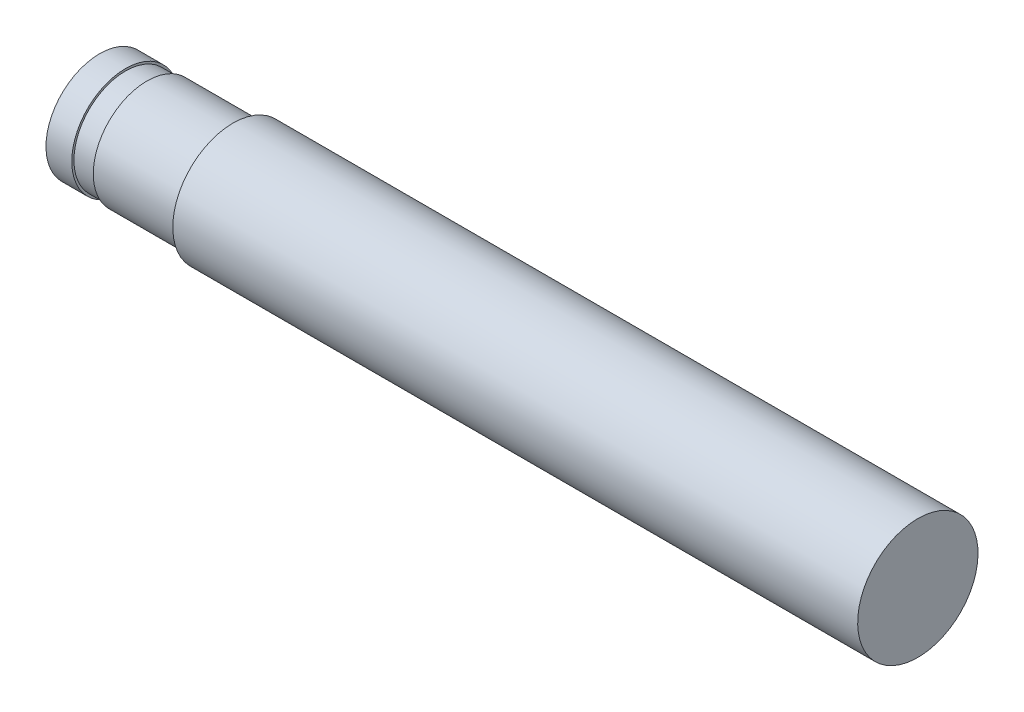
ISO-10303-21;
HEADER;
FILE_DESCRIPTION(('STEP AP214'),'2;1');
FILE_NAME('part.step','',(''),(''),'','','');
FILE_SCHEMA(('AUTOMOTIVE_DESIGN { 1 0 10303 214 1 1 1 1 }'));
ENDSEC;
DATA;
#1=APPLICATION_CONTEXT('core data for automotive mechanical design processes');
#2=APPLICATION_PROTOCOL_DEFINITION('international standard','automotive_design',2000,#1);
#3=PRODUCT_CONTEXT('',#1,'mechanical');
#4=PRODUCT('Part','Part','',(#3));
#5=PRODUCT_RELATED_PRODUCT_CATEGORY('part','',(#4));
#6=PRODUCT_DEFINITION_FORMATION('','',#4);
#7=PRODUCT_DEFINITION_CONTEXT('part definition',#1,'design');
#8=PRODUCT_DEFINITION('design','',#6,#7);
#9=PRODUCT_DEFINITION_SHAPE('','',#8);
#10=(LENGTH_UNIT() NAMED_UNIT(*) SI_UNIT(.MILLI.,.METRE.));
#11=(NAMED_UNIT(*) PLANE_ANGLE_UNIT() SI_UNIT($,.RADIAN.));
#12=(NAMED_UNIT(*) SI_UNIT($,.STERADIAN.) SOLID_ANGLE_UNIT());
#13=UNCERTAINTY_MEASURE_WITH_UNIT(LENGTH_MEASURE(1.E-05),#10,'distance_accuracy_value','');
#14=(GEOMETRIC_REPRESENTATION_CONTEXT(3) GLOBAL_UNCERTAINTY_ASSIGNED_CONTEXT((#13)) GLOBAL_UNIT_ASSIGNED_CONTEXT((#10,
#11,#12)) REPRESENTATION_CONTEXT('',''));
#15=CARTESIAN_POINT('',(0.,0.,0.));
#16=DIRECTION('',(0.,0.,1.));
#17=DIRECTION('',(1.,0.,0.));
#18=AXIS2_PLACEMENT_3D('',#15,#16,#17);
#19=CARTESIAN_POINT('',(-553.,37.4999999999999,0.));
#20=DIRECTION('',(1.,0.,0.));
#21=DIRECTION('',(0.,1.,0.));
#22=AXIS2_PLACEMENT_3D('',#19,#20,#21);
#23=PLANE('',#22);
#24=CARTESIAN_POINT('',(-553.,0.,0.));
#25=DIRECTION('',(1.,0.,0.));
#26=DIRECTION('',(0.,1.,0.));
#27=AXIS2_PLACEMENT_3D('',#24,#25,#26);
#28=CIRCLE('',#27,37.5);
#29=CARTESIAN_POINT('',(-553.,37.4999999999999,0.));
#30=VERTEX_POINT('',#29);
#31=EDGE_CURVE('E10',#30,#30,#28,.T.);
#32=ORIENTED_EDGE('',*,*,#31,.T.);
#33=EDGE_LOOP('',(#32));
#34=FACE_BOUND('',#33,.T.);
#35=CARTESIAN_POINT('',(-553.,0.,0.));
#36=DIRECTION('',(1.,0.,0.));
#37=DIRECTION('',(0.,1.,0.));
#38=AXIS2_PLACEMENT_3D('',#35,#36,#37);
#39=CIRCLE('',#38,36.);
#40=CARTESIAN_POINT('',(-553.,35.9999999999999,0.));
#41=VERTEX_POINT('',#40);
#42=EDGE_CURVE('E58',#41,#41,#39,.T.);
#43=ORIENTED_EDGE('',*,*,#42,.F.);
#44=EDGE_LOOP('',(#43));
#45=FACE_BOUND('',#44,.T.);
#46=ADVANCED_FACE('F30',(#34,#45),#23,.T.);
#47=CARTESIAN_POINT('',(0.,0.,0.));
#48=DIRECTION('',(1.,0.,0.));
#49=DIRECTION('',(0.,1.,0.));
#50=AXIS2_PLACEMENT_3D('',#47,#48,#49);
#51=CYLINDRICAL_SURFACE('',#50,37.5);
#52=CARTESIAN_POINT('',(-571.,0.,0.));
#53=DIRECTION('',(1.,0.,0.));
#54=DIRECTION('',(0.,1.,0.));
#55=AXIS2_PLACEMENT_3D('',#52,#53,#54);
#56=CIRCLE('',#55,37.5);
#57=CARTESIAN_POINT('',(-571.,37.4999999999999,0.));
#58=VERTEX_POINT('',#57);
#59=EDGE_CURVE('E36',#58,#58,#56,.T.);
#60=ORIENTED_EDGE('',*,*,#59,.T.);
#61=EDGE_LOOP('',(#60));
#62=FACE_BOUND('',#61,.T.);
#63=ORIENTED_EDGE('',*,*,#31,.F.);
#64=EDGE_LOOP('',(#63));
#65=FACE_BOUND('',#64,.T.);
#66=ADVANCED_FACE('F66',(#62,#65),#51,.T.);
#67=CARTESIAN_POINT('',(-571.,37.4999999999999,0.));
#68=DIRECTION('',(-1.,0.,0.));
#69=DIRECTION('',(0.,-1.,0.));
#70=AXIS2_PLACEMENT_3D('',#67,#68,#69);
#71=PLANE('',#70);
#72=ORIENTED_EDGE('',*,*,#59,.F.);
#73=EDGE_LOOP('',(#72));
#74=FACE_BOUND('',#73,.T.);
#75=ADVANCED_FACE('F70',(#74),#71,.T.);
#76=CARTESIAN_POINT('',(0.,42.,0.));
#77=DIRECTION('',(1.,0.,0.));
#78=DIRECTION('',(0.,1.,0.));
#79=AXIS2_PLACEMENT_3D('',#76,#77,#78);
#80=PLANE('',#79);
#81=CARTESIAN_POINT('',(0.,0.,0.));
#82=DIRECTION('',(1.,0.,0.));
#83=DIRECTION('',(0.,1.,0.));
#84=AXIS2_PLACEMENT_3D('',#81,#82,#83);
#85=CIRCLE('',#84,42.);
#86=CARTESIAN_POINT('',(0.,42.,0.));
#87=VERTEX_POINT('',#86);
#88=EDGE_CURVE('E40',#87,#87,#85,.T.);
#89=ORIENTED_EDGE('',*,*,#88,.T.);
#90=EDGE_LOOP('',(#89));
#91=FACE_BOUND('',#90,.T.);
#92=ADVANCED_FACE('F74',(#91),#80,.T.);
#93=CARTESIAN_POINT('',(0.,0.,0.));
#94=DIRECTION('',(1.,0.,0.));
#95=DIRECTION('',(0.,1.,0.));
#96=AXIS2_PLACEMENT_3D('',#93,#94,#95);
#97=CYLINDRICAL_SURFACE('',#96,42.);
#98=CARTESIAN_POINT('',(-478.,0.,0.));
#99=DIRECTION('',(1.,0.,0.));
#100=DIRECTION('',(0.,1.,0.));
#101=AXIS2_PLACEMENT_3D('',#98,#99,#100);
#102=CIRCLE('',#101,42.0000000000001);
#103=CARTESIAN_POINT('',(-478.,42.,0.));
#104=VERTEX_POINT('',#103);
#105=EDGE_CURVE('E44',#104,#104,#102,.T.);
#106=ORIENTED_EDGE('',*,*,#105,.T.);
#107=EDGE_LOOP('',(#106));
#108=FACE_BOUND('',#107,.T.);
#109=ORIENTED_EDGE('',*,*,#88,.F.);
#110=EDGE_LOOP('',(#109));
#111=FACE_BOUND('',#110,.T.);
#112=ADVANCED_FACE('F81',(#108,#111),#97,.T.);
#113=CARTESIAN_POINT('',(-478.,37.4999999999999,0.));
#114=DIRECTION('',(-1.,0.,0.));
#115=DIRECTION('',(0.,-1.,0.));
#116=AXIS2_PLACEMENT_3D('',#113,#114,#115);
#117=PLANE('',#116);
#118=CARTESIAN_POINT('',(-478.,0.,0.));
#119=DIRECTION('',(1.,0.,0.));
#120=DIRECTION('',(0.,1.,0.));
#121=AXIS2_PLACEMENT_3D('',#118,#119,#120);
#122=CIRCLE('',#121,37.5);
#123=CARTESIAN_POINT('',(-478.,37.4999999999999,0.));
#124=VERTEX_POINT('',#123);
#125=EDGE_CURVE('E49',#124,#124,#122,.T.);
#126=ORIENTED_EDGE('',*,*,#125,.T.);
#127=EDGE_LOOP('',(#126));
#128=FACE_BOUND('',#127,.T.);
#129=ORIENTED_EDGE('',*,*,#105,.F.);
#130=EDGE_LOOP('',(#129));
#131=FACE_BOUND('',#130,.T.);
#132=ADVANCED_FACE('F85',(#128,#131),#117,.T.);
#133=CARTESIAN_POINT('',(0.,0.,0.));
#134=DIRECTION('',(1.,0.,0.));
#135=DIRECTION('',(0.,1.,0.));
#136=AXIS2_PLACEMENT_3D('',#133,#134,#135);
#137=CYLINDRICAL_SURFACE('',#136,37.5);
#138=CARTESIAN_POINT('',(-538.,0.,0.));
#139=DIRECTION('',(1.,0.,0.));
#140=DIRECTION('',(0.,1.,0.));
#141=AXIS2_PLACEMENT_3D('',#138,#139,#140);
#142=CIRCLE('',#141,37.5);
#143=CARTESIAN_POINT('',(-538.,37.4999999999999,0.));
#144=VERTEX_POINT('',#143);
#145=EDGE_CURVE('E52',#144,#144,#142,.T.);
#146=ORIENTED_EDGE('',*,*,#145,.T.);
#147=EDGE_LOOP('',(#146));
#148=FACE_BOUND('',#147,.T.);
#149=ORIENTED_EDGE('',*,*,#125,.F.);
#150=EDGE_LOOP('',(#149));
#151=FACE_BOUND('',#150,.T.);
#152=ADVANCED_FACE('F89',(#148,#151),#137,.T.);
#153=CARTESIAN_POINT('',(-538.,35.9999999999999,0.));
#154=DIRECTION('',(-1.,0.,0.));
#155=DIRECTION('',(0.,-1.,0.));
#156=AXIS2_PLACEMENT_3D('',#153,#154,#155);
#157=PLANE('',#156);
#158=CARTESIAN_POINT('',(-538.,0.,0.));
#159=DIRECTION('',(1.,0.,0.));
#160=DIRECTION('',(0.,1.,0.));
#161=AXIS2_PLACEMENT_3D('',#158,#159,#160);
#162=CIRCLE('',#161,36.);
#163=CARTESIAN_POINT('',(-538.,35.9999999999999,0.));
#164=VERTEX_POINT('',#163);
#165=EDGE_CURVE('E55',#164,#164,#162,.T.);
#166=ORIENTED_EDGE('',*,*,#165,.T.);
#167=EDGE_LOOP('',(#166));
#168=FACE_BOUND('',#167,.T.);
#169=ORIENTED_EDGE('',*,*,#145,.F.);
#170=EDGE_LOOP('',(#169));
#171=FACE_BOUND('',#170,.T.);
#172=ADVANCED_FACE('F93',(#168,#171),#157,.T.);
#173=CARTESIAN_POINT('',(0.,0.,0.));
#174=DIRECTION('',(1.,0.,0.));
#175=DIRECTION('',(0.,1.,0.));
#176=AXIS2_PLACEMENT_3D('',#173,#174,#175);
#177=CYLINDRICAL_SURFACE('',#176,36.);
#178=ORIENTED_EDGE('',*,*,#42,.T.);
#179=EDGE_LOOP('',(#178));
#180=FACE_BOUND('',#179,.T.);
#181=ORIENTED_EDGE('',*,*,#165,.F.);
#182=EDGE_LOOP('',(#181));
#183=FACE_BOUND('',#182,.T.);
#184=ADVANCED_FACE('F62',(#180,#183),#177,.T.);
#185=CLOSED_SHELL('',(#46,#66,#75,#92,#112,#132,#152,#172,#184));
#186=MANIFOLD_SOLID_BREP('B2',#185);
#187=ADVANCED_BREP_SHAPE_REPRESENTATION('',(#18,#186),#14);
#188=SHAPE_DEFINITION_REPRESENTATION(#9,#187);
ENDSEC;
END-ISO-10303-21;
